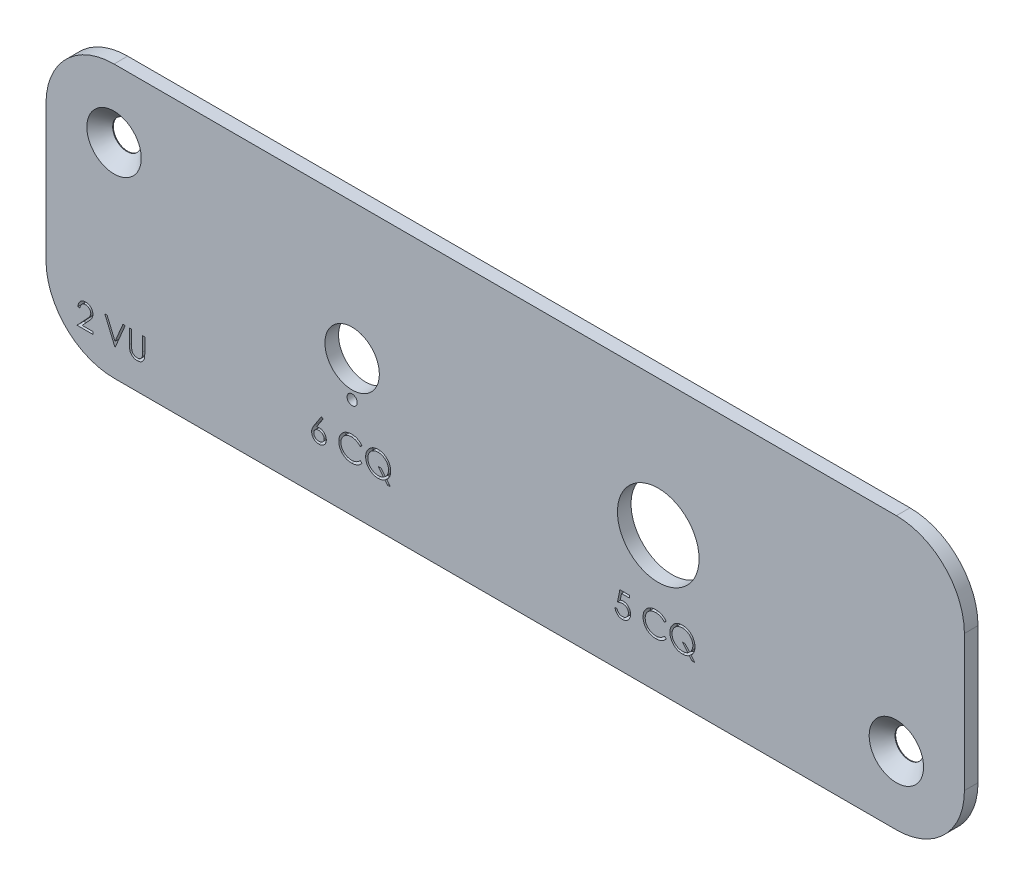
from build123d import *

# Parameters (mm, degrees)
ESQUISSE1_W             = 135
ESQUISSE1_H             = 40
BOSS_EXTRU_1_DEPTH      = 2
ESQUISSE2_R             = 2.1
ENL_V_MAT_EXTRU_1_DEPTH = 2
CHANFREIN1_SIZE         = 1.9
ESQUISSE3_R             = 4
ESQUISSE3_R_2           = 6
ESQUISSE3_R_3           = 0.75
ENL_V_MAT_EXTRU_3_DEPTH = 141.815482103
ENL_V_MAT_EXTRU_4_DEPTH = 1
ENL_V_MAT_EXTRU_5_DEPTH = 1
CONG_1_R                = 10


with BuildPart() as part:
    # Esquisse1 → Boss.-Extru.1 (new body)
    with BuildSketch(Plane.XY):
        with Locations((67.5, 20)):
            Rectangle(ESQUISSE1_W, ESQUISSE1_H)
    extrude(amount=BOSS_EXTRU_1_DEPTH)

    # Esquisse2 → Enl_v. mat.-Extru.1 (cut)
    with BuildSketch(Plane.XY.offset(2)):
        with Locations((10, 30)):
            Circle(ESQUISSE2_R)
        with Locations((125, 10)):
            Circle(ESQUISSE2_R)
    extrude(amount=-ENL_V_MAT_EXTRU_1_DEPTH, mode=Mode.SUBTRACT)

    # Chanfrein1
    chanfrein1_edges = [part.edges().sort_by_distance(p)[0] for p in [
        (7.9, 30, 2),
        (122.9, 10, 2),
    ]]
    chamfer(chanfrein1_edges, length=CHANFREIN1_SIZE)

    # Esquisse3 → Enl_v. mat.-Extru.3 (cut, through all)
    with BuildSketch(Plane.XY.offset(2)):
        with Locations((45, 20)):
            Circle(ESQUISSE3_R)
        with Locations((90, 20)):
            Circle(ESQUISSE3_R_2)
        with Locations((45, 14.75)):
            Circle(ESQUISSE3_R_3)
    extrude(amount=-ENL_V_MAT_EXTRU_3_DEPTH, mode=Mode.SUBTRACT)

    # Esquisse4 → Enl_v. mat.-Extru.4 (cut)
    with BuildSketch(Plane.XY.offset(2)):
        with BuildLine():
            Line((5.008669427, 6.446928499), (4.694566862, 6.446928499))
            add(Edge.make_bspline(
                [(4.694566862, 6.446928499), (4.696614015, 6.488599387), (4.70063457, 6.570439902), (4.719462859, 6.689763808), (4.746403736, 6.803818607), (4.78449519, 6.911688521), (4.831801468, 7.014327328), (4.888531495, 7.111327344), (4.955725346, 7.202318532), (5.03193208, 7.286457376), (5.114700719, 7.363644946), (5.204006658, 7.430300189), (5.297851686, 7.486617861), (5.395951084, 7.533699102), (5.499411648, 7.569038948), (5.607294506, 7.595260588), (5.720073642, 7.611036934), (5.796913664, 7.612732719), (5.835993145, 7.613595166)],
                knots=[0, 0, 0, 0, 1.10065271, 2.161652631, 3.183658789, 4.190468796, 5.17591951, 6.163126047, 7.15150782, 8.156236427, 9.156009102, 10.134482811, 11.092018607, 12.041330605, 13.001268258, 13.972401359, 14.968799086, 16, 16, 16, 16], degree=3))
            add(Edge.make_bspline(
                [(5.835993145, 7.613595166), (5.874371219, 7.61269671), (5.949782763, 7.610931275), (6.059844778, 7.595770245), (6.164622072, 7.572024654), (6.263909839, 7.538709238), (6.356915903, 7.49392481), (6.444338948, 7.440127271), (6.527219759, 7.37790744), (6.601826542, 7.304653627), (6.670334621, 7.226451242), (6.729436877, 7.142963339), (6.78005004, 7.056734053), (6.82223772, 6.967105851), (6.853293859, 6.873234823), (6.876872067, 6.77648762), (6.890199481, 6.675862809), (6.892244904, 6.607756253), (6.893284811, 6.573130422)],
                knots=[0, 0, 0, 0, 1.111607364, 2.184268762, 3.212621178, 4.221274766, 5.211760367, 6.196651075, 7.1921475, 8.207485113, 9.220403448, 10.201281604, 11.166441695, 12.114753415, 13.065576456, 14.026450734, 14.996634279, 16, 16, 16, 16], degree=3))
            add(Edge.make_bspline(
                [(6.893284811, 6.573130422), (6.891591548, 6.524382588), (6.888234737, 6.427742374), (6.85952036, 6.285727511), (6.814673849, 6.148134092), (6.760676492, 6.03739679), (6.706204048, 5.948163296), (6.657116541, 5.874694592), (6.59965173, 5.795589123), (6.532973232, 5.711111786), (6.45846036, 5.620600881), (6.375438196, 5.524111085), (6.283314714, 5.422639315), (6.218656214, 5.353333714), (6.185151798, 5.317421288)],
                knots=[0, 0, 0, 0, 1.184426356, 2.348067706, 3.509069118, 4.696110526, 5.333549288, 6.050745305, 6.844228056, 7.710549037, 8.667450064, 9.695053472, 10.805634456, 12, 12, 12, 12], degree=3))
            Line((6.185151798, 5.317421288), (5.309450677, 4.382825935))
            Line((5.309450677, 4.382825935), (6.938156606, 4.382825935))
            Line((6.938156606, 4.382825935), (6.938156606, 4.023851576))
            Line((6.938156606, 4.023851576), (4.559951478, 4.023851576))
            Line((4.559951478, 4.023851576), (5.917323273, 5.472369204))
            add(Edge.make_bspline(
                [(5.917323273, 5.472369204), (5.95037116, 5.506867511), (6.013849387, 5.573131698), (6.103631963, 5.669874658), (6.184270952, 5.759624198), (6.256288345, 5.842210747), (6.31812185, 5.918842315), (6.372994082, 5.987037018), (6.416959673, 6.049791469), (6.464675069, 6.122532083), (6.51088905, 6.2113444), (6.550601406, 6.319878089), (6.574816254, 6.431605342), (6.57772109, 6.507107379), (6.579182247, 6.545085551)],
                knots=[0, 0, 0, 0, 1.329631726, 2.553950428, 3.673215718, 4.687767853, 5.603093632, 6.413772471, 7.123043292, 7.734684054, 8.834405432, 9.900288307, 10.943827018, 12, 12, 12, 12], degree=3))
            add(Edge.make_bspline(
                [(6.579182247, 6.545085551), (6.578546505, 6.568966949), (6.577293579, 6.616032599), (6.566235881, 6.685038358), (6.549525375, 6.751603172), (6.525580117, 6.815931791), (6.493973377, 6.877377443), (6.455499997, 6.936014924), (6.411109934, 6.992703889), (6.359758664, 7.045857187), (6.303347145, 7.094538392), (6.243752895, 7.137662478), (6.180702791, 7.173701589), (6.114462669, 7.203245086), (6.045217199, 7.226420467), (5.972832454, 7.242479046), (5.897508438, 7.25256153), (5.846074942, 7.253925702), (5.819867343, 7.254620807)],
                knots=[0, 0, 0, 0, 0.991446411, 1.95395049, 2.89581595, 3.838931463, 4.798493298, 5.75982156, 6.748411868, 7.785213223, 8.824556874, 9.840280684, 10.836137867, 11.835679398, 12.848801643, 13.863922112, 14.911575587, 16, 16, 16, 16], degree=3))
            add(Edge.make_bspline(
                [(5.819867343, 7.254620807), (5.79249651, 7.253905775), (5.738744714, 7.252501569), (5.659825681, 7.242678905), (5.584539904, 7.225733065), (5.512698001, 7.202556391), (5.444178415, 7.173097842), (5.379314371, 7.136406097), (5.318251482, 7.092622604), (5.260874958, 7.042982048), (5.208010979, 6.987714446), (5.161564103, 6.926104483), (5.120980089, 6.859277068), (5.085570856, 6.787412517), (5.056815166, 6.709858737), (5.034842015, 6.626891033), (5.017455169, 6.538869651), (5.011646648, 6.478084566), (5.008669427, 6.446928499)],
                knots=[0, 0, 0, 0, 1.031018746, 2.02475058, 2.990194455, 3.934040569, 4.864654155, 5.795059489, 6.735614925, 7.690564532, 8.649604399, 9.611025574, 10.590972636, 11.591080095, 12.624614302, 13.701020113, 14.821632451, 16, 16, 16, 16], degree=3))
        make_face()
        Polygon((8.643284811, 7.523851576), (8.979823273, 7.523851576), (10.146489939, 4.765638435), (11.313156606, 7.523851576), (11.649695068, 7.523851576), (10.168925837, 4.023851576), (10.124054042, 4.023851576), align=None)
        with BuildLine():
            Line((12.277900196, 7.523851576), (12.59200276, 7.523851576))
            Line((12.59200276, 7.523851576), (12.59200276, 5.426796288))
            add(Edge.make_bspline(
                [(12.59200276, 5.426796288), (12.591956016, 5.397115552), (12.591867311, 5.340791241), (12.592459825, 5.260622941), (12.594119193, 5.189350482), (12.595165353, 5.126699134), (12.597492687, 5.072956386), (12.599390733, 5.027831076), (12.60183129, 4.991536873), (12.604764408, 4.970355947), (12.606025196, 4.961251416)],
                knots=[0, 0, 0, 0, 1.528628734, 2.90083645, 4.128790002, 5.200304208, 6.127813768, 6.898992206, 7.526736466, 8, 8, 8, 8], degree=3))
            add(Edge.make_bspline(
                [(12.606025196, 4.961251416), (12.611202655, 4.928404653), (12.621265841, 4.864561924), (12.646912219, 4.773653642), (12.68272972, 4.691722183), (12.725172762, 4.616210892), (12.781105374, 4.549221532), (12.848108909, 4.487509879), (12.929286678, 4.433538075), (13.019547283, 4.384187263), (13.116832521, 4.344522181), (13.216243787, 4.314528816), (13.316286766, 4.296249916), (13.383262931, 4.294133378), (13.416521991, 4.293082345)],
                knots=[0, 0, 0, 0, 1.035780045, 2.013197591, 2.933192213, 3.817615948, 4.702609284, 5.640816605, 6.646850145, 7.73207398, 8.84249596, 9.914020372, 10.964143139, 12, 12, 12, 12], degree=3))
            add(Edge.make_bspline(
                [(13.416521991, 4.293082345), (13.445075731, 4.294156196), (13.502018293, 4.296297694), (13.586624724, 4.309559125), (13.669024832, 4.333459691), (13.749625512, 4.364299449), (13.825176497, 4.40504704), (13.895719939, 4.45211788), (13.958683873, 4.507328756), (14.016141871, 4.5684291), (14.066176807, 4.6373689), (14.109547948, 4.712647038), (14.145073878, 4.795396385), (14.162617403, 4.853550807), (14.171630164, 4.883426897)],
                knots=[0, 0, 0, 0, 0.994687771, 1.983630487, 2.973142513, 3.978332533, 4.983357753, 5.956394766, 6.925816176, 7.893390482, 8.871859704, 9.88551698, 10.913711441, 12, 12, 12, 12], degree=3))
            add(Edge.make_bspline(
                [(14.171630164, 4.883426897), (14.174630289, 4.895775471), (14.181315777, 4.923293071), (14.187562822, 4.969814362), (14.194069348, 5.024703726), (14.198583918, 5.088355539), (14.202985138, 5.160556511), (14.205618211, 5.241682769), (14.206835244, 5.331439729), (14.207197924, 5.394076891), (14.207387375, 5.426796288)],
                knots=[0, 0, 0, 0, 0.558680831, 1.244966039, 2.062412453, 2.990489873, 4.051219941, 5.244515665, 6.560634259, 8, 8, 8, 8], degree=3))
            Line((14.207387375, 5.426796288), (14.207387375, 7.523851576))
            Line((14.207387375, 7.523851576), (14.521489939, 7.523851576))
            Line((14.521489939, 7.523851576), (14.521489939, 5.409969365))
            add(Edge.make_bspline(
                [(14.521489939, 5.409969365), (14.521235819, 5.371870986), (14.520739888, 5.297519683), (14.516439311, 5.188568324), (14.509582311, 5.085215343), (14.499894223, 4.987446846), (14.48705722, 4.895612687), (14.472782, 4.808907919), (14.454602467, 4.727954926), (14.433369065, 4.652122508), (14.409095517, 4.579936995), (14.377654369, 4.51142838), (14.342229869, 4.444513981), (14.300215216, 4.380205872), (14.253003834, 4.318219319), (14.199552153, 4.258930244), (14.141627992, 4.201391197), (14.078268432, 4.147078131), (14.010517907, 4.097269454), (13.938577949, 4.053471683), (13.86300118, 4.016448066), (13.783984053, 3.985972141), (13.701492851, 3.963057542), (13.615525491, 3.945982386), (13.525886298, 3.936280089), (13.464921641, 3.934838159), (13.434050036, 3.934107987)],
                knots=[0, 0, 0, 0, 1.316592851, 2.569410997, 3.76748051, 4.895814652, 5.963796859, 6.97159953, 7.931736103, 8.829262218, 9.692595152, 10.560224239, 11.431080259, 12.30701507, 13.211635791, 14.121146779, 15.063487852, 16.031507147, 17.00238618, 17.966455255, 18.938106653, 19.907068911, 20.888905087, 21.893141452, 22.933117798, 24, 24, 24, 24], degree=3))
            add(Edge.make_bspline(
                [(13.434050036, 3.934107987), (13.400380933, 3.934892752), (13.334322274, 3.936432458), (13.236984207, 3.945255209), (13.14367001, 3.961873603), (13.053394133, 3.983033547), (12.967385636, 4.012217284), (12.884492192, 4.046315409), (12.806133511, 4.088192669), (12.731038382, 4.134786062), (12.661213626, 4.1872107), (12.597116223, 4.244350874), (12.538640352, 4.305291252), (12.486771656, 4.370691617), (12.440650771, 4.440043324), (12.400920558, 4.513542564), (12.366807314, 4.59116088), (12.349200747, 4.645114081), (12.340300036, 4.672389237)],
                knots=[0, 0, 0, 0, 1.13879206, 2.234305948, 3.301075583, 4.341971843, 5.366689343, 6.369221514, 7.369726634, 8.367512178, 9.355451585, 10.318319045, 11.268648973, 12.207971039, 13.137398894, 14.081662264, 15.030215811, 16, 16, 16, 16], degree=3))
            add(Edge.make_bspline(
                [(12.340300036, 4.672389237), (12.335122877, 4.691021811), (12.323893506, 4.73143628), (12.311868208, 4.798322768), (12.301759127, 4.875337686), (12.292253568, 4.962486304), (12.286644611, 5.059836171), (12.281727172, 5.167345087), (12.277865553, 5.285143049), (12.277888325, 5.367197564), (12.277900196, 5.409969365)],
                knots=[0, 0, 0, 0, 0.625038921, 1.35572334, 2.194682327, 3.136881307, 4.189498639, 5.346923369, 6.617055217, 8, 8, 8, 8], degree=3))
            Line((12.277900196, 5.409969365), (12.277900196, 7.523851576))
        make_face()
    extrude(amount=-ENL_V_MAT_EXTRU_4_DEPTH, mode=Mode.SUBTRACT)

    # Esquisse5 → Enl_v. mat.-Extru.5 (cut)
    # profile 1 of 6: a face of its own
    with BuildSketch(Plane.XY.offset(2)):
        with BuildLine():
            Line((40.483264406, 10.341977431), (40.725151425, 10.151973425))
            Line((40.725151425, 10.151973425), (39.800371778, 8.737810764))
            add(Edge.make_bspline(
                [(39.800371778, 8.737810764), (39.861942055, 8.747624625), (39.982041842, 8.76676767), (40.10360774, 8.769925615), (40.162851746, 8.771464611)],
                knots=[0, 0, 0, 0, 1.025318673, 2, 2, 2, 2], degree=3))
            add(Edge.make_bspline(
                [(40.162851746, 8.771464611), (40.198424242, 8.770508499), (40.268447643, 8.768626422), (40.371254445, 8.754142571), (40.470043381, 8.731317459), (40.564404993, 8.698045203), (40.654677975, 8.655542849), (40.741380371, 8.604603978), (40.822882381, 8.542598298), (40.90023356, 8.473333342), (40.970460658, 8.396616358), (41.032636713, 8.315215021), (41.084863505, 8.22921414), (41.127237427, 8.138657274), (41.160142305, 8.043684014), (41.18412995, 7.944415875), (41.198309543, 7.840784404), (41.200235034, 7.770306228), (41.201213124, 7.734505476)],
                knots=[0, 0, 0, 0, 1.04369286, 2.054478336, 3.041073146, 4.015093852, 4.984733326, 5.965804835, 6.960378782, 7.985147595, 9.009457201, 10.008161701, 10.986880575, 11.956520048, 12.937015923, 13.931873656, 14.949455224, 16, 16, 16, 16], degree=3))
            add(Edge.make_bspline(
                [(41.201213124, 7.734505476), (41.199790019, 7.685525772), (41.196989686, 7.589145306), (41.16908589, 7.4487686), (41.125726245, 7.315036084), (41.063748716, 7.190082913), (40.986766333, 7.074080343), (40.892888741, 6.971294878), (40.785445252, 6.87962484), (40.663958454, 6.802968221), (40.53321549, 6.74036517), (40.395863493, 6.695399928), (40.253236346, 6.667716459), (40.156431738, 6.664245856), (40.107463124, 6.662490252)],
                knots=[0, 0, 0, 0, 1.031375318, 2.029502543, 3.004789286, 3.987476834, 4.960371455, 5.9300674, 6.912260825, 7.929083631, 8.949397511, 9.960523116, 10.96833055, 12, 12, 12, 12], degree=3))
            add(Edge.make_bspline(
                [(40.107463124, 6.662490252), (40.060366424, 6.664018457), (39.967076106, 6.667045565), (39.829843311, 6.694011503), (39.697980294, 6.737718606), (39.572410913, 6.797932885), (39.4560903, 6.873990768), (39.352024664, 6.965553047), (39.260732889, 7.070662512), (39.184758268, 7.189302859), (39.124499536, 7.316792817), (39.079309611, 7.449729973), (39.052913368, 7.587629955), (39.049224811, 7.681111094), (39.04736697, 7.72819538)],
                knots=[0, 0, 0, 0, 1.012016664, 2.004627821, 2.994792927, 3.992885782, 4.990978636, 5.973936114, 6.964471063, 7.975201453, 8.993600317, 9.990122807, 10.98767138, 12, 12, 12, 12], degree=3))
            add(Edge.make_bspline(
                [(39.04736697, 7.72819538), (39.048548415, 7.764239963), (39.0509607, 7.837836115), (39.067804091, 7.949300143), (39.094868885, 8.063351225), (39.125179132, 8.160105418), (39.157204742, 8.23936694), (39.183857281, 8.303270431), (39.217031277, 8.369031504), (39.252404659, 8.43890514), (39.293161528, 8.511090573), (39.337477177, 8.586794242), (39.386576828, 8.66481217), (39.420996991, 8.717756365), (39.438592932, 8.744821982)],
                knots=[0, 0, 0, 0, 1.173818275, 2.396712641, 3.66331629, 4.989737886, 5.693666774, 6.447286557, 7.243889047, 8.091586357, 8.998013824, 9.943181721, 10.948533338, 12, 12, 12, 12], degree=3))
            Line((39.438592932, 8.744821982), (40.483264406, 10.341977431))
        make_face()
        with BuildLine():
            add(Edge.make_bspline(
                [(40.096946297, 8.412490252), (40.070284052, 8.411712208), (40.018204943, 8.410192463), (39.941797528, 8.401367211), (39.869484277, 8.384748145), (39.800307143, 8.363581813), (39.73555944, 8.334478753), (39.6747706, 8.299126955), (39.617705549, 8.257505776), (39.564961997, 8.210204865), (39.517142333, 8.158416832), (39.475961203, 8.10294731), (39.440438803, 8.045133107), (39.411556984, 7.984491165), (39.389066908, 7.921044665), (39.372798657, 7.855085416), (39.363744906, 7.78617111), (39.362238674, 7.739438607), (39.361469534, 7.715575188)],
                knots=[0, 0, 0, 0, 1.129588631, 2.206414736, 3.251139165, 4.268635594, 5.265702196, 6.250456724, 7.242448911, 8.251968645, 9.246821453, 10.222880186, 11.173611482, 12.116736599, 13.062300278, 14.020270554, 14.989073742, 16, 16, 16, 16], degree=3))
            add(Edge.make_bspline(
                [(39.361469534, 7.715575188), (39.362095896, 7.691925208), (39.363324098, 7.645551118), (39.374476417, 7.577211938), (39.3915115, 7.51144703), (39.416851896, 7.448595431), (39.447078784, 7.387699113), (39.486984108, 7.330963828), (39.531200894, 7.274943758), (39.584054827, 7.223942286), (39.64077819, 7.176485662), (39.701379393, 7.135005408), (39.764539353, 7.099519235), (39.831110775, 7.071708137), (39.900149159, 7.048883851), (39.972229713, 7.032822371), (40.047402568, 7.023741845), (40.098324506, 7.022233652), (40.124290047, 7.021464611)],
                knots=[0, 0, 0, 0, 0.989467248, 1.94019797, 2.891935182, 3.827694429, 4.772920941, 5.730924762, 6.725747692, 7.756678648, 8.79901574, 9.819492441, 10.826891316, 11.826466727, 12.835195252, 13.867842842, 14.912794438, 16, 16, 16, 16], degree=3))
            add(Edge.make_bspline(
                [(40.124290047, 7.021464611), (40.150255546, 7.022233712), (40.2011774, 7.023742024), (40.276350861, 7.032821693), (40.348429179, 7.048886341), (40.417475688, 7.071699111), (40.484017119, 7.099552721), (40.54712184, 7.13478464), (40.607149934, 7.176740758), (40.663910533, 7.223861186), (40.716544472, 7.275234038), (40.761821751, 7.330463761), (40.800504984, 7.388157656), (40.831939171, 7.448355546), (40.857000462, 7.511485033), (40.87412193, 7.577201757), (40.885251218, 7.645553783), (40.886482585, 7.691926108), (40.88711056, 7.715575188)],
                knots=[0, 0, 0, 0, 1.087397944, 2.132534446, 3.165364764, 4.174271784, 5.174024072, 6.181601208, 7.194203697, 8.236725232, 9.267838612, 10.269026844, 11.221737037, 12.171628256, 13.107553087, 14.05945871, 15.010357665, 16, 16, 16, 16], degree=3))
            add(Edge.make_bspline(
                [(40.88711056, 7.715575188), (40.886560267, 7.739469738), (40.885480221, 7.786366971), (40.873264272, 7.855054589), (40.856321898, 7.921379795), (40.830738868, 7.984925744), (40.797502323, 8.045441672), (40.757018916, 8.103233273), (40.710186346, 8.15874362), (40.656088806, 8.210306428), (40.597198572, 8.257453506), (40.534582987, 8.299073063), (40.469075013, 8.334198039), (40.400741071, 8.363505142), (40.328798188, 8.384654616), (40.254407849, 8.401307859), (40.176618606, 8.410169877), (40.123841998, 8.411706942), (40.096946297, 8.412490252)],
                knots=[0, 0, 0, 0, 0.978206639, 1.919901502, 2.851605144, 3.780102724, 4.718870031, 5.675451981, 6.667674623, 7.690630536, 8.733308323, 9.756129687, 10.767539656, 11.776269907, 12.797430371, 13.836405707, 14.897401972, 16, 16, 16, 16], degree=3))
        make_face(mode=Mode.SUBTRACT)
    # profile 2 of 6: a face of its own
    with BuildSketch(Plane.XY.offset(2)):
        with BuildLine():
            Line((46.451213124, 9.610006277), (46.176373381, 9.399669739))
            add(Edge.make_bspline(
                [(46.176373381, 9.399669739), (46.156767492, 9.423035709), (46.117820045, 9.469452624), (46.055160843, 9.534632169), (45.9898592, 9.59569743), (45.921940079, 9.65293931), (45.850180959, 9.704356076), (45.776320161, 9.752627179), (45.699122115, 9.795894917), (45.592370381, 9.848357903), (45.452722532, 9.903104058), (45.276927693, 9.949007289), (45.093416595, 9.978228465), (44.968218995, 9.981393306), (44.904538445, 9.983003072)],
                knots=[0, 0, 0, 0, 0.757959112, 1.505699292, 2.245454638, 2.979532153, 3.711538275, 4.438200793, 5.171680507, 5.909471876, 7.393775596, 8.890124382, 10.418191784, 12, 12, 12, 12], degree=3))
            add(Edge.make_bspline(
                [(44.904538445, 9.983003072), (44.869455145, 9.98259911), (44.799614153, 9.981794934), (44.695965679, 9.971185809), (44.594252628, 9.956274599), (44.494541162, 9.934149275), (44.396958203, 9.906176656), (44.300865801, 9.872751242), (44.207655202, 9.831396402), (44.116036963, 9.785688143), (44.028257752, 9.734060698), (43.945202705, 9.677747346), (43.867174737, 9.617378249), (43.794112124, 9.552727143), (43.725940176, 9.484085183), (43.663152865, 9.410720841), (43.605967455, 9.332868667), (43.55325043, 9.25155526), (43.506037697, 9.167017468), (43.466507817, 9.078942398), (43.431502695, 8.988838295), (43.403803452, 8.895687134), (43.381878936, 8.800144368), (43.366751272, 8.70195358), (43.356262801, 8.601319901), (43.355462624, 8.533110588), (43.355059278, 8.498728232)],
                knots=[0, 0, 0, 0, 1.054917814, 2.100044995, 3.131103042, 4.146048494, 5.169673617, 6.183595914, 7.203665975, 8.234915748, 9.262203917, 10.264457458, 11.251630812, 12.227803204, 13.197192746, 14.159520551, 15.12972552, 16.100847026, 17.073214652, 18.039054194, 19.002613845, 19.979014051, 20.95965708, 21.949030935, 22.966165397, 24, 24, 24, 24], degree=3))
            add(Edge.make_bspline(
                [(43.355059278, 8.498728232), (43.356321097, 8.446996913), (43.358798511, 8.345429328), (43.380846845, 8.196658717), (43.414351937, 8.054138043), (43.464567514, 7.918758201), (43.526486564, 7.788849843), (43.604727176, 7.66661099), (43.695343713, 7.550194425), (43.799618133, 7.442351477), (43.914023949, 7.343837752), (44.03677186, 7.25708717), (44.167556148, 7.184772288), (44.304932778, 7.124596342), (44.449958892, 7.078339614), (44.602373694, 7.04577549), (44.76184569, 7.02453331), (44.87081509, 7.022499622), (44.92627322, 7.021464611)],
                knots=[0, 0, 0, 0, 1.029171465, 2.020641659, 2.987623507, 3.938342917, 4.889210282, 5.84687017, 6.821220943, 7.821438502, 8.827599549, 9.822697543, 10.807740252, 11.797342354, 12.80366471, 13.83203677, 14.896651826, 16, 16, 16, 16], degree=3))
            add(Edge.make_bspline(
                [(44.92627322, 7.021464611), (44.987375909, 7.02315339), (45.107640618, 7.026477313), (45.284008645, 7.054636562), (45.45284441, 7.10029448), (45.614156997, 7.164192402), (45.767491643, 7.24725769), (45.913088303, 7.347955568), (46.051069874, 7.4672439), (46.134041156, 7.558327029), (46.176373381, 7.604797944)],
                knots=[0, 0, 0, 0, 1.028121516, 2.023589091, 2.998037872, 3.967518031, 4.937445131, 5.927275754, 6.942489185, 8, 8, 8, 8], degree=3))
            Line((46.176373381, 7.604797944), (46.451213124, 7.396564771))
            add(Edge.make_bspline(
                [(46.451213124, 7.396564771), (46.429095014, 7.368026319), (46.384964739, 7.311086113), (46.313506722, 7.230814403), (46.238229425, 7.155310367), (46.158573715, 7.085182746), (46.075455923, 7.019028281), (45.987383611, 6.958726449), (45.895514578, 6.903435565), (45.800160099, 6.852808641), (45.701421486, 6.807891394), (45.599417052, 6.769437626), (45.494586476, 6.736312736), (45.386924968, 6.709060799), (45.276209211, 6.687789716), (45.162838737, 6.673570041), (45.046568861, 6.663828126), (44.96812744, 6.662940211), (44.928376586, 6.662490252)],
                knots=[0, 0, 0, 0, 0.986787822, 1.968848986, 2.935600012, 3.899624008, 4.868462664, 5.837806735, 6.815139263, 7.798259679, 8.787526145, 9.778297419, 10.776456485, 11.791383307, 12.812564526, 13.85620153, 14.913611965, 16, 16, 16, 16], degree=3))
            add(Edge.make_bspline(
                [(44.928376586, 6.662490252), (44.890732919, 6.662752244), (44.816297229, 6.663270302), (44.706398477, 6.671662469), (44.599408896, 6.683112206), (44.49563427, 6.700352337), (44.394508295, 6.720696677), (44.296947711, 6.747967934), (44.2019925, 6.778517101), (44.11002416, 6.814422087), (44.02096446, 6.85493827), (43.935100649, 6.900729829), (43.852472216, 6.951411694), (43.772266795, 7.005866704), (43.695669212, 7.065844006), (43.622015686, 7.13051064), (43.55089321, 7.199648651), (43.506890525, 7.249503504), (43.48476681, 7.274569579)],
                knots=[0, 0, 0, 0, 1.114604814, 2.203992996, 3.262667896, 4.300477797, 5.318619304, 6.316056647, 7.298880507, 8.271930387, 9.238335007, 10.195173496, 11.151986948, 12.108099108, 13.064862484, 14.031167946, 15.010108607, 16, 16, 16, 16], degree=3))
            add(Edge.make_bspline(
                [(43.48476681, 7.274569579), (43.449331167, 7.318110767), (43.37888769, 7.404667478), (43.288762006, 7.544953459), (43.211614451, 7.691421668), (43.14923853, 7.844841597), (43.100475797, 8.004868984), (43.066694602, 8.171584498), (43.044742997, 8.344832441), (43.042232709, 8.462669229), (43.040956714, 8.522566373)],
                knots=[0, 0, 0, 0, 0.994628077, 1.977248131, 2.950237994, 3.925870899, 4.908910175, 5.911660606, 6.938484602, 8, 8, 8, 8], degree=3))
            add(Edge.make_bspline(
                [(43.040956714, 8.522566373), (43.042511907, 8.585521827), (43.045571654, 8.709382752), (43.071567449, 8.891156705), (43.113386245, 9.065308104), (43.172783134, 9.231511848), (43.248088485, 9.390642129), (43.341115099, 9.541483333), (43.450782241, 9.685000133), (43.576229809, 9.819014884), (43.713797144, 9.941554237), (43.861115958, 10.049360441), (44.017897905, 10.139077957), (44.182415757, 10.214074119), (44.355901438, 10.271718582), (44.537984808, 10.312071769), (44.728323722, 10.337188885), (44.858186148, 10.340364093), (44.924169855, 10.341977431)],
                knots=[0, 0, 0, 0, 1.032925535, 2.032216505, 3.007276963, 3.968222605, 4.92396291, 5.891752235, 6.871517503, 7.883894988, 8.900124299, 9.891468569, 10.874487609, 11.85992873, 12.854644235, 13.869047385, 14.917252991, 16, 16, 16, 16], degree=3))
            add(Edge.make_bspline(
                [(44.924169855, 10.341977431), (44.964384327, 10.341495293), (45.043984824, 10.340540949), (45.161737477, 10.331234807), (45.276379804, 10.315721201), (45.387990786, 10.294605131), (45.497113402, 10.268397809), (45.602913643, 10.234257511), (45.70601233, 10.19522098), (45.805759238, 10.150262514), (45.901675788, 10.099795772), (45.993732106, 10.044380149), (46.081196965, 9.984084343), (46.164685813, 9.919421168), (46.242802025, 9.849022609), (46.317763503, 9.774825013), (46.387024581, 9.694691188), (46.429777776, 9.638286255), (46.451213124, 9.610006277)],
                knots=[0, 0, 0, 0, 1.096760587, 2.17092713, 3.219439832, 4.250915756, 5.268269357, 6.278326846, 7.281116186, 8.274029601, 9.260640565, 10.235837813, 11.203064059, 12.156899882, 13.114053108, 14.069676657, 15.032185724, 16, 16, 16, 16], degree=3))
        make_face()
    # profile 3 of 6: a face of its own
    with BuildSketch(Plane.XY.offset(2)):
        with BuildLine():
            Line((50.086529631, 7.142057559), (50.624290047, 6.483003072))
            Line((50.624290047, 6.483003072), (50.232362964, 6.483003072))
            Line((50.232362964, 6.483003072), (49.84394149, 6.958363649))
            add(Edge.make_bspline(
                [(49.84394149, 6.958363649), (49.804984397, 6.934689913), (49.727787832, 6.887778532), (49.607421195, 6.827312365), (49.484660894, 6.776996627), (49.359778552, 6.735426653), (49.232956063, 6.702152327), (49.103550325, 6.679058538), (48.972030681, 6.665648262), (48.883668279, 6.663546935), (48.839233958, 6.662490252)],
                knots=[0, 0, 0, 0, 1.030216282, 2.041455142, 3.041201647, 4.026904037, 5.014869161, 6.002481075, 6.995518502, 8, 8, 8, 8], degree=3))
            add(Edge.make_bspline(
                [(48.839233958, 6.662490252), (48.775573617, 6.664023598), (48.650309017, 6.667040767), (48.466338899, 6.693381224), (48.28975528, 6.734061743), (48.12091013, 6.792922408), (47.959619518, 6.86810489), (47.80595838, 6.960794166), (47.659848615, 7.069706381), (47.523447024, 7.194129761), (47.398721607, 7.329485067), (47.289282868, 7.474106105), (47.196230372, 7.625593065), (47.120991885, 7.784701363), (47.061280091, 7.95004585), (47.020588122, 8.123001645), (46.994248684, 8.302539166), (46.991214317, 8.424782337), (46.989674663, 8.486809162)],
                knots=[0, 0, 0, 0, 1.055750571, 2.07740284, 3.077223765, 4.05828044, 5.038417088, 6.02463293, 7.030503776, 8.057169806, 9.083586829, 10.080154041, 11.061747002, 12.027853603, 12.995569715, 13.972756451, 14.971366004, 16, 16, 16, 16], degree=3))
            add(Edge.make_bspline(
                [(46.989674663, 8.486809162), (46.990222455, 8.528440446), (46.991314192, 8.611410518), (47.003943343, 8.73429769), (47.022707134, 8.85516182), (47.049247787, 8.973500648), (47.083991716, 9.089799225), (47.125646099, 9.20382823), (47.176115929, 9.315293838), (47.233170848, 9.423967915), (47.296803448, 9.528908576), (47.366119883, 9.628622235), (47.44129068, 9.722126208), (47.52226262, 9.809377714), (47.608712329, 9.890569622), (47.699896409, 9.967038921), (47.797759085, 10.03594087), (47.89971746, 10.10001692), (48.006343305, 10.156362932), (48.115551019, 10.206734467), (48.228157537, 10.24760462), (48.342701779, 10.282430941), (48.459878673, 10.309018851), (48.579596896, 10.32764509), (48.701772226, 10.340396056), (48.784279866, 10.341447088), (48.825912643, 10.341977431)],
                knots=[0, 0, 0, 0, 1.030721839, 2.054201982, 3.056261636, 4.058906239, 5.055198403, 6.060579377, 7.06322398, 8.083343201, 9.098870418, 10.10084648, 11.0888991, 12.067804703, 13.046436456, 14.024708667, 15.012489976, 16.008294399, 17.005242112, 17.997338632, 18.984424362, 19.969624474, 20.960977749, 21.957320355, 22.969278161, 24, 24, 24, 24], degree=3))
            add(Edge.make_bspline(
                [(48.825912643, 10.341977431), (48.889573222, 10.340451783), (49.014606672, 10.337455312), (49.198121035, 10.311110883), (49.374184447, 10.270267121), (49.542671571, 10.211706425), (49.703432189, 10.136334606), (49.85639876, 10.043664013), (50.001808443, 9.934744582), (50.137497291, 9.810312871), (50.261928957, 9.67462403), (50.370848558, 9.529214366), (50.463518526, 9.376247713), (50.538892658, 9.215487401), (50.597444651, 9.046999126), (50.638374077, 8.870714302), (50.664592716, 8.686947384), (50.667622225, 8.561685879), (50.669161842, 8.498027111)],
                knots=[0, 0, 0, 0, 1.050672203, 2.063587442, 3.054842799, 4.031180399, 5.003107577, 5.981273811, 6.979214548, 7.998088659, 9.016962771, 10.014903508, 10.993069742, 11.96499692, 12.941334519, 13.932589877, 14.949327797, 16, 16, 16, 16], degree=3))
            add(Edge.make_bspline(
                [(50.669161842, 8.498027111), (50.667479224, 8.431789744), (50.664170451, 8.301537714), (50.636012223, 8.110536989), (50.590738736, 7.928086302), (50.526535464, 7.754305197), (50.443535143, 7.58922526), (50.343341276, 7.431195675), (50.224747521, 7.280227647), (50.133087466, 7.188599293), (50.086529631, 7.142057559)],
                knots=[0, 0, 0, 0, 1.045660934, 2.056233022, 3.041853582, 4.009978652, 4.97562384, 5.954545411, 6.961031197, 8, 8, 8, 8], degree=3))
        make_face()
        with BuildLine():
            add(Edge.make_bspline(
                [(49.87549197, 7.400771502), (49.913680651, 7.439554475), (49.98879948, 7.515842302), (50.086264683, 7.640950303), (50.170094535, 7.770997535), (50.237209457, 7.907713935), (50.290608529, 8.049386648), (50.327501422, 8.197138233), (50.350601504, 8.350296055), (50.353562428, 8.45447541), (50.355059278, 8.507141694)],
                knots=[0, 0, 0, 0, 1.052210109, 2.069743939, 3.061837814, 4.040478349, 5.010453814, 5.985306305, 6.981502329, 8, 8, 8, 8], degree=3))
            add(Edge.make_bspline(
                [(50.355059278, 8.507141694), (50.354668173, 8.541058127), (50.353895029, 8.608104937), (50.343264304, 8.707322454), (50.328224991, 8.804348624), (50.306452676, 8.899010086), (50.278415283, 8.991115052), (50.243786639, 9.08053849), (50.20324143, 9.167568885), (50.155974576, 9.251665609), (50.103866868, 9.332706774), (50.045864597, 9.409701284), (49.982784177, 9.482252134), (49.915314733, 9.551554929), (49.842155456, 9.616181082), (49.763568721, 9.676102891), (49.680522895, 9.732770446), (49.592607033, 9.78392023), (49.502009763, 9.830944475), (49.409261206, 9.87166456), (49.315140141, 9.906153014), (49.219792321, 9.934118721), (49.123341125, 9.956131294), (49.025617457, 9.971153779), (48.926874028, 9.981773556), (48.860529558, 9.982592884), (48.827314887, 9.983003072)],
                knots=[0, 0, 0, 0, 1.032958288, 2.041976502, 3.037103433, 4.023477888, 4.998866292, 5.968231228, 6.943073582, 7.921783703, 8.90545537, 9.876780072, 10.85618943, 11.833110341, 12.821898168, 13.827467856, 14.842673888, 15.88323808, 16.924703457, 17.951432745, 18.967462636, 19.976958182, 20.977218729, 21.979378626, 22.98839684, 24, 24, 24, 24], degree=3))
            add(Edge.make_bspline(
                [(48.827314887, 9.983003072), (48.793867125, 9.982590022), (48.727057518, 9.981764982), (48.627837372, 9.971212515), (48.529889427, 9.956114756), (48.433644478, 9.934211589), (48.338761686, 9.906191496), (48.245535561, 9.871494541), (48.15315536, 9.831780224), (48.063538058, 9.784786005), (47.976840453, 9.733196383), (47.894385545, 9.677092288), (47.81730332, 9.615913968), (47.744862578, 9.550646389), (47.677244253, 9.480785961), (47.614129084, 9.406797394), (47.556625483, 9.327822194), (47.503941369, 9.245273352), (47.457376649, 9.15906118), (47.41538118, 9.07074115), (47.381271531, 8.979339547), (47.353268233, 8.885587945), (47.330385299, 8.789719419), (47.31563636, 8.691177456), (47.304925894, 8.590577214), (47.304163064, 8.52259606), (47.303777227, 8.488211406)],
                knots=[0, 0, 0, 0, 1.013205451, 2.023808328, 3.020541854, 4.015386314, 5.012622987, 6.016502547, 7.02834558, 8.057881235, 9.080621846, 10.084476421, 11.077781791, 12.060654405, 13.037357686, 14.022218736, 15.005346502, 15.995617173, 16.98763393, 17.973029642, 18.956998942, 19.940662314, 20.93709383, 21.940823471, 22.958474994, 24, 24, 24, 24], degree=3))
            add(Edge.make_bspline(
                [(47.303777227, 8.488211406), (47.305090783, 8.437658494), (47.307674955, 8.338205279), (47.329097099, 8.192190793), (47.365014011, 8.052404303), (47.415263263, 7.918645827), (47.478344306, 7.790144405), (47.556790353, 7.668158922), (47.650266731, 7.553154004), (47.755237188, 7.444339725), (47.870706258, 7.345758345), (47.993114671, 7.258995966), (48.121417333, 7.185385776), (48.256017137, 7.125973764), (48.395910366, 7.078263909), (48.542201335, 7.045963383), (48.693933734, 7.024553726), (48.797325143, 7.022503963), (48.849750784, 7.021464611)],
                knots=[0, 0, 0, 0, 1.022526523, 2.011626, 2.97850031, 3.937665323, 4.897797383, 5.869804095, 6.865337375, 7.89202157, 8.925035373, 9.93268082, 10.923937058, 11.912550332, 12.905497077, 13.90928476, 14.939882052, 16, 16, 16, 16], degree=3))
            add(Edge.make_bspline(
                [(48.849750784, 7.021464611), (48.885769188, 7.021856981), (48.957011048, 7.022633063), (49.062065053, 7.033213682), (49.164548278, 7.04810612), (49.263511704, 7.07075606), (49.359813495, 7.098914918), (49.452880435, 7.133167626), (49.543206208, 7.1737745), (49.600639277, 7.205899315), (49.62939822, 7.221985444)],
                knots=[0, 0, 0, 0, 1.060694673, 2.097979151, 3.107774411, 4.11000626, 5.086069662, 6.061987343, 7.029562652, 8, 8, 8, 8], degree=3))
            Line((49.62939822, 7.221985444), (48.841337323, 8.188131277))
            Line((48.841337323, 8.188131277), (49.233264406, 8.188131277))
            Line((49.233264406, 8.188131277), (49.87549197, 7.400771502))
        make_face(mode=Mode.SUBTRACT)
    # profile 4 of 6: a face of its own
    with BuildSketch(Plane.XY.offset(2)):
        with BuildLine():
            Line((85.790456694, 10.252233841), (85.790456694, 9.893259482))
            Line((85.790456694, 9.893259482), (84.599951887, 9.893259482))
            Line((84.599951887, 9.893259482), (84.411350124, 8.972686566))
            add(Edge.make_bspline(
                [(84.411350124, 8.972686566), (84.448405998, 8.982916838), (84.520195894, 9.002736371), (84.626155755, 9.024742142), (84.726747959, 9.038007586), (84.792023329, 9.039818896), (84.823609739, 9.04069538)],
                knots=[0, 0, 0, 0, 1.100273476, 2.13160584, 3.095893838, 4, 4, 4, 4], degree=3))
            add(Edge.make_bspline(
                [(84.823609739, 9.04069538), (84.862693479, 9.039849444), (84.939541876, 9.038186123), (85.051980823, 9.022214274), (85.159313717, 8.997074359), (85.261316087, 8.961953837), (85.358176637, 8.917044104), (85.449004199, 8.860944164), (85.535162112, 8.795410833), (85.615104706, 8.720065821), (85.687629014, 8.637144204), (85.751395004, 8.547986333), (85.805557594, 8.453458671), (85.849118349, 8.352658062), (85.883902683, 8.246698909), (85.907054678, 8.134466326), (85.922471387, 8.017018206), (85.924193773, 7.936713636), (85.925072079, 7.895763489)],
                knots=[0, 0, 0, 0, 1.052922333, 2.070308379, 3.05430497, 4.020497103, 4.973039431, 5.925935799, 6.892292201, 7.88610001, 8.88166317, 9.857072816, 10.836096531, 11.812156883, 12.81219415, 13.836441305, 14.89672472, 16, 16, 16, 16], degree=3))
            add(Edge.make_bspline(
                [(85.925072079, 7.895763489), (85.924407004, 7.867241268), (85.923085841, 7.810582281), (85.916367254, 7.72643808), (85.903431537, 7.644075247), (85.886063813, 7.563482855), (85.863521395, 7.484813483), (85.836232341, 7.407841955), (85.802836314, 7.333047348), (85.766204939, 7.259721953), (85.724958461, 7.189523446), (85.679179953, 7.12387446), (85.630814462, 7.061790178), (85.578773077, 7.003936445), (85.522572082, 6.950693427), (85.462892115, 6.901745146), (85.400209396, 6.856263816), (85.333554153, 6.81609562), (85.26441167, 6.779132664), (85.191783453, 6.748809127), (85.117322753, 6.721698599), (85.039957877, 6.700089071), (84.959864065, 6.683156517), (84.876909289, 6.671655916), (84.791528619, 6.663279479), (84.733653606, 6.662755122), (84.704419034, 6.662490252)],
                knots=[0, 0, 0, 0, 1.056347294, 2.098418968, 3.122841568, 4.141288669, 5.149314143, 6.15115421, 7.162517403, 8.180376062, 9.185164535, 10.17417709, 11.141909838, 12.097768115, 13.052685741, 14.0056014, 14.954263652, 15.917497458, 16.885230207, 17.854509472, 18.828990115, 19.81800267, 20.826176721, 21.857883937, 22.917946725, 24, 24, 24, 24], degree=3))
            add(Edge.make_bspline(
                [(84.704419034, 6.662490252), (84.669544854, 6.66318109), (84.600934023, 6.664540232), (84.500413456, 6.678758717), (84.40369885, 6.699122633), (84.311568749, 6.729758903), (84.223197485, 6.768146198), (84.139774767, 6.816662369), (84.059168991, 6.871641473), (83.984656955, 6.936521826), (83.915500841, 7.007437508), (83.853594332, 7.084395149), (83.798460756, 7.166124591), (83.750983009, 7.253022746), (83.710484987, 7.344861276), (83.678669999, 7.441984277), (83.652991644, 7.543884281), (83.642128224, 7.614037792), (83.636610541, 7.649669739)],
                knots=[0, 0, 0, 0, 1.0467383, 2.05933395, 3.04377827, 4.011590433, 4.970194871, 5.932262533, 6.905835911, 7.896367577, 8.894135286, 9.877477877, 10.858688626, 11.851381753, 12.8477658, 13.868841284, 14.917554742, 16, 16, 16, 16], degree=3))
            Line((83.636610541, 7.649669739), (83.950713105, 7.649669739))
            add(Edge.make_bspline(
                [(83.950713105, 7.649669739), (83.958441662, 7.616293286), (83.973296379, 7.552141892), (84.005902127, 7.46201055), (84.045768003, 7.381691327), (84.093172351, 7.310121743), (84.149722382, 7.247712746), (84.214251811, 7.192095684), (84.286599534, 7.141920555), (84.366992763, 7.100097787), (84.451805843, 7.064429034), (84.540573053, 7.040677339), (84.630877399, 7.023976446), (84.691955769, 7.022304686), (84.722648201, 7.021464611)],
                knots=[0, 0, 0, 0, 1.136247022, 2.183929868, 3.172523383, 4.106158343, 5.02341133, 5.958108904, 6.928429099, 7.938127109, 8.96079061, 9.975095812, 10.982467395, 12, 12, 12, 12], degree=3))
            add(Edge.make_bspline(
                [(84.722648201, 7.021464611), (84.752606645, 7.022285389), (84.811595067, 7.023901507), (84.898406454, 7.036340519), (84.982219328, 7.05549809), (85.062206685, 7.084167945), (85.139768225, 7.119012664), (85.212941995, 7.16372774), (85.283844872, 7.215187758), (85.350273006, 7.274144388), (85.411112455, 7.339114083), (85.464868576, 7.408591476), (85.50964549, 7.482708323), (85.547379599, 7.560181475), (85.576032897, 7.641860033), (85.596473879, 7.727361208), (85.608476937, 7.816896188), (85.610128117, 7.877965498), (85.610969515, 7.909084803)],
                knots=[0, 0, 0, 0, 1.027316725, 2.022795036, 3.002884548, 3.971462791, 4.93288096, 5.914575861, 6.907176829, 7.935150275, 8.956128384, 9.956726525, 10.942570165, 11.921478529, 12.907843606, 13.90538589, 14.932640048, 16, 16, 16, 16], degree=3))
            add(Edge.make_bspline(
                [(85.610969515, 7.909084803), (85.610311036, 7.937160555), (85.609022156, 7.992114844), (85.598491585, 8.07251405), (85.580174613, 8.148587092), (85.554750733, 8.220701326), (85.522471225, 8.288924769), (85.483024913, 8.353327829), (85.435671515, 8.413061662), (85.381579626, 8.468154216), (85.322321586, 8.518999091), (85.256877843, 8.562343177), (85.186617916, 8.598807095), (85.112388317, 8.630275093), (85.032423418, 8.652875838), (84.948306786, 8.669843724), (84.859130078, 8.679659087), (84.79815939, 8.681020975), (84.766818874, 8.681721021)],
                knots=[0, 0, 0, 0, 1.045622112, 2.046656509, 3.013763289, 3.955457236, 4.890082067, 5.820317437, 6.762574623, 7.722996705, 8.69280354, 9.665887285, 10.63943826, 11.638615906, 12.663482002, 13.728887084, 14.832589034, 16, 16, 16, 16], degree=3))
            add(Edge.make_bspline(
                [(84.766818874, 8.681721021), (84.739689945, 8.68114043), (84.68367559, 8.679941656), (84.597752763, 8.671115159), (84.50746104, 8.656875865), (84.413146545, 8.637289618), (84.314526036, 8.611658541), (84.211807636, 8.58094404), (84.104775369, 8.544222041), (84.032657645, 8.516489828), (83.9955849, 8.502233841)],
                knots=[0, 0, 0, 0, 0.817624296, 1.688186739, 2.600797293, 3.572016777, 4.590301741, 5.671205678, 6.80286297, 8, 8, 8, 8], degree=3))
            Line((83.9955849, 8.502233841), (84.354559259, 10.252233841))
            Line((84.354559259, 10.252233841), (85.790456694, 10.252233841))
        make_face()
    # profile 5 of 6: a face of its own
    with BuildSketch(Plane.XY.offset(2)):
        with BuildLine():
            Line((91.175072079, 9.610006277), (90.900232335, 9.399669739))
            add(Edge.make_bspline(
                [(90.900232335, 9.399669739), (90.880626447, 9.423035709), (90.841679, 9.469452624), (90.779019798, 9.534632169), (90.713718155, 9.59569743), (90.645799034, 9.65293931), (90.574039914, 9.704356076), (90.500179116, 9.752627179), (90.42298107, 9.795894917), (90.316229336, 9.848357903), (90.176581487, 9.903104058), (90.000786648, 9.949007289), (89.81727555, 9.978228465), (89.69207795, 9.981393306), (89.6283974, 9.983003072)],
                knots=[0, 0, 0, 0, 0.757959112, 1.505699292, 2.245454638, 2.979532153, 3.711538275, 4.438200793, 5.171680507, 5.909471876, 7.393775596, 8.890124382, 10.418191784, 12, 12, 12, 12], degree=3))
            add(Edge.make_bspline(
                [(89.6283974, 9.983003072), (89.5933141, 9.98259911), (89.523473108, 9.981794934), (89.419824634, 9.971185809), (89.318111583, 9.956274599), (89.218400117, 9.934149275), (89.120817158, 9.906176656), (89.024724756, 9.872751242), (88.931514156, 9.831396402), (88.839895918, 9.785688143), (88.752116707, 9.734060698), (88.669061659, 9.677747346), (88.591033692, 9.617378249), (88.517971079, 9.552727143), (88.449799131, 9.484085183), (88.38701182, 9.410720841), (88.32982641, 9.332868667), (88.277109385, 9.25155526), (88.229896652, 9.167017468), (88.190366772, 9.078942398), (88.15536165, 8.988838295), (88.127662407, 8.895687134), (88.10573789, 8.800144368), (88.090610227, 8.70195358), (88.080121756, 8.601319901), (88.079321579, 8.533110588), (88.078918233, 8.498728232)],
                knots=[0, 0, 0, 0, 1.054917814, 2.100044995, 3.131103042, 4.146048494, 5.169673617, 6.183595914, 7.203665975, 8.234915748, 9.262203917, 10.264457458, 11.251630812, 12.227803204, 13.197192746, 14.159520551, 15.12972552, 16.100847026, 17.073214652, 18.039054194, 19.002613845, 19.979014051, 20.95965708, 21.949030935, 22.966165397, 24, 24, 24, 24], degree=3))
            add(Edge.make_bspline(
                [(88.078918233, 8.498728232), (88.080180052, 8.446996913), (88.082657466, 8.345429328), (88.1047058, 8.196658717), (88.138210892, 8.054138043), (88.188426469, 7.918758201), (88.250345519, 7.788849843), (88.328586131, 7.66661099), (88.419202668, 7.550194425), (88.523477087, 7.442351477), (88.637882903, 7.343837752), (88.760630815, 7.25708717), (88.891415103, 7.184772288), (89.028791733, 7.124596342), (89.173817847, 7.078339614), (89.326232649, 7.04577549), (89.485704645, 7.02453331), (89.594674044, 7.022499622), (89.650132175, 7.021464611)],
                knots=[0, 0, 0, 0, 1.029171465, 2.020641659, 2.987623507, 3.938342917, 4.889210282, 5.84687017, 6.821220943, 7.821438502, 8.827599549, 9.822697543, 10.807740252, 11.797342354, 12.80366471, 13.83203677, 14.896651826, 16, 16, 16, 16], degree=3))
            add(Edge.make_bspline(
                [(89.650132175, 7.021464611), (89.711234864, 7.02315339), (89.831499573, 7.026477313), (90.007867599, 7.054636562), (90.176703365, 7.10029448), (90.338015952, 7.164192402), (90.491350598, 7.24725769), (90.636947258, 7.347955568), (90.774928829, 7.4672439), (90.857900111, 7.558327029), (90.900232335, 7.604797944)],
                knots=[0, 0, 0, 0, 1.028121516, 2.023589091, 2.998037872, 3.967518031, 4.937445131, 5.927275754, 6.942489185, 8, 8, 8, 8], degree=3))
            Line((90.900232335, 7.604797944), (91.175072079, 7.396564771))
            add(Edge.make_bspline(
                [(91.175072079, 7.396564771), (91.152953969, 7.368026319), (91.108823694, 7.311086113), (91.037365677, 7.230814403), (90.96208838, 7.155310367), (90.88243267, 7.085182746), (90.799314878, 7.019028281), (90.711242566, 6.958726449), (90.619373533, 6.903435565), (90.524019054, 6.852808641), (90.425280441, 6.807891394), (90.323276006, 6.769437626), (90.218445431, 6.736312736), (90.110783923, 6.709060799), (90.000068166, 6.687789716), (89.886697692, 6.673570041), (89.770427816, 6.663828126), (89.691986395, 6.662940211), (89.652235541, 6.662490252)],
                knots=[0, 0, 0, 0, 0.986787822, 1.968848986, 2.935600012, 3.899624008, 4.868462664, 5.837806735, 6.815139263, 7.798259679, 8.787526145, 9.778297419, 10.776456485, 11.791383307, 12.812564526, 13.85620153, 14.913611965, 16, 16, 16, 16], degree=3))
            add(Edge.make_bspline(
                [(89.652235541, 6.662490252), (89.614591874, 6.662752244), (89.540156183, 6.663270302), (89.430257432, 6.671662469), (89.323267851, 6.683112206), (89.219493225, 6.700352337), (89.11836725, 6.720696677), (89.020806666, 6.747967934), (88.925851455, 6.778517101), (88.833883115, 6.814422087), (88.744823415, 6.85493827), (88.658959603, 6.900729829), (88.576331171, 6.951411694), (88.49612575, 7.005866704), (88.419528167, 7.065844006), (88.345874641, 7.13051064), (88.274752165, 7.199648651), (88.23074948, 7.249503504), (88.208625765, 7.274569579)],
                knots=[0, 0, 0, 0, 1.114604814, 2.203992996, 3.262667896, 4.300477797, 5.318619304, 6.316056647, 7.298880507, 8.271930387, 9.238335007, 10.195173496, 11.151986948, 12.108099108, 13.064862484, 14.031167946, 15.010108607, 16, 16, 16, 16], degree=3))
            add(Edge.make_bspline(
                [(88.208625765, 7.274569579), (88.173190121, 7.318110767), (88.102746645, 7.404667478), (88.012620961, 7.544953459), (87.935473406, 7.691421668), (87.873097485, 7.844841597), (87.824334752, 8.004868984), (87.790553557, 8.171584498), (87.768601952, 8.344832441), (87.766091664, 8.462669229), (87.764815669, 8.522566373)],
                knots=[0, 0, 0, 0, 0.994628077, 1.977248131, 2.950237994, 3.925870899, 4.908910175, 5.911660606, 6.938484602, 8, 8, 8, 8], degree=3))
            add(Edge.make_bspline(
                [(87.764815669, 8.522566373), (87.766370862, 8.585521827), (87.769430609, 8.709382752), (87.795426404, 8.891156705), (87.8372452, 9.065308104), (87.896642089, 9.231511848), (87.97194744, 9.390642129), (88.064974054, 9.541483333), (88.174641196, 9.685000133), (88.300088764, 9.819014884), (88.437656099, 9.941554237), (88.584974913, 10.049360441), (88.74175686, 10.139077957), (88.906274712, 10.214074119), (89.079760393, 10.271718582), (89.261843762, 10.312071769), (89.452182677, 10.337188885), (89.582045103, 10.340364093), (89.64802881, 10.341977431)],
                knots=[0, 0, 0, 0, 1.032925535, 2.032216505, 3.007276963, 3.968222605, 4.92396291, 5.891752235, 6.871517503, 7.883894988, 8.900124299, 9.891468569, 10.874487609, 11.85992873, 12.854644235, 13.869047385, 14.917252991, 16, 16, 16, 16], degree=3))
            add(Edge.make_bspline(
                [(89.64802881, 10.341977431), (89.688243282, 10.341495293), (89.767843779, 10.340540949), (89.885596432, 10.331234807), (90.000238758, 10.315721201), (90.11184974, 10.294605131), (90.220972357, 10.268397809), (90.326772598, 10.234257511), (90.429871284, 10.19522098), (90.529618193, 10.150262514), (90.625534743, 10.099795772), (90.717591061, 10.044380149), (90.80505592, 9.984084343), (90.888544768, 9.919421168), (90.966660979, 9.849022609), (91.041622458, 9.774825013), (91.110883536, 9.694691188), (91.153636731, 9.638286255), (91.175072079, 9.610006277)],
                knots=[0, 0, 0, 0, 1.096760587, 2.17092713, 3.219439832, 4.250915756, 5.268269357, 6.278326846, 7.281116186, 8.274029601, 9.260640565, 10.235837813, 11.203064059, 12.156899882, 13.114053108, 14.069676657, 15.032185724, 16, 16, 16, 16], degree=3))
        make_face()
    # profile 6 of 6: a face of its own
    with BuildSketch(Plane.XY.offset(2)):
        with BuildLine():
            Line((94.810388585, 7.142057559), (95.348149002, 6.483003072))
            Line((95.348149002, 6.483003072), (94.956221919, 6.483003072))
            Line((94.956221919, 6.483003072), (94.567800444, 6.958363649))
            add(Edge.make_bspline(
                [(94.567800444, 6.958363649), (94.528843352, 6.934689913), (94.451646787, 6.887778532), (94.33128015, 6.827312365), (94.208519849, 6.776996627), (94.083637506, 6.735426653), (93.956815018, 6.702152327), (93.82740928, 6.679058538), (93.695889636, 6.665648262), (93.607527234, 6.663546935), (93.563092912, 6.662490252)],
                knots=[0, 0, 0, 0, 1.030216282, 2.041455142, 3.041201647, 4.026904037, 5.014869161, 6.002481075, 6.995518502, 8, 8, 8, 8], degree=3))
            add(Edge.make_bspline(
                [(93.563092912, 6.662490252), (93.499432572, 6.664023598), (93.374167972, 6.667040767), (93.190197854, 6.693381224), (93.013614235, 6.734061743), (92.844769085, 6.792922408), (92.683478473, 6.86810489), (92.529817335, 6.960794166), (92.383707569, 7.069706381), (92.247305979, 7.194129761), (92.122580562, 7.329485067), (92.013141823, 7.474106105), (91.920089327, 7.625593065), (91.84485084, 7.784701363), (91.785139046, 7.95004585), (91.744447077, 8.123001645), (91.718107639, 8.302539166), (91.715073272, 8.424782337), (91.713533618, 8.486809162)],
                knots=[0, 0, 0, 0, 1.055750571, 2.07740284, 3.077223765, 4.05828044, 5.038417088, 6.02463293, 7.030503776, 8.057169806, 9.083586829, 10.080154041, 11.061747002, 12.027853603, 12.995569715, 13.972756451, 14.971366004, 16, 16, 16, 16], degree=3))
            add(Edge.make_bspline(
                [(91.713533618, 8.486809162), (91.71408141, 8.528440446), (91.715173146, 8.611410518), (91.727802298, 8.73429769), (91.746566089, 8.85516182), (91.773106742, 8.973500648), (91.807850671, 9.089799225), (91.849505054, 9.20382823), (91.899974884, 9.315293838), (91.957029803, 9.423967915), (92.020662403, 9.528908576), (92.089978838, 9.628622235), (92.165149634, 9.722126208), (92.246121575, 9.809377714), (92.332571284, 9.890569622), (92.423755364, 9.967038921), (92.52161804, 10.03594087), (92.623576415, 10.10001692), (92.73020226, 10.156362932), (92.839409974, 10.206734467), (92.952016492, 10.24760462), (93.066560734, 10.282430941), (93.183737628, 10.309018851), (93.303455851, 10.32764509), (93.425631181, 10.340396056), (93.508138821, 10.341447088), (93.549771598, 10.341977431)],
                knots=[0, 0, 0, 0, 1.030721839, 2.054201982, 3.056261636, 4.058906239, 5.055198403, 6.060579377, 7.06322398, 8.083343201, 9.098870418, 10.10084648, 11.0888991, 12.067804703, 13.046436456, 14.024708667, 15.012489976, 16.008294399, 17.005242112, 17.997338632, 18.984424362, 19.969624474, 20.960977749, 21.957320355, 22.969278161, 24, 24, 24, 24], degree=3))
            add(Edge.make_bspline(
                [(93.549771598, 10.341977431), (93.613432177, 10.340451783), (93.738465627, 10.337455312), (93.92197999, 10.311110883), (94.098043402, 10.270267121), (94.266530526, 10.211706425), (94.427291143, 10.136334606), (94.580257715, 10.043664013), (94.725667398, 9.934744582), (94.861356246, 9.810312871), (94.985787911, 9.67462403), (95.094707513, 9.529214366), (95.187377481, 9.376247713), (95.262751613, 9.215487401), (95.321303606, 9.046999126), (95.362233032, 8.870714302), (95.388451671, 8.686947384), (95.39148118, 8.561685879), (95.393020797, 8.498027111)],
                knots=[0, 0, 0, 0, 1.050672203, 2.063587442, 3.054842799, 4.031180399, 5.003107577, 5.981273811, 6.979214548, 7.998088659, 9.016962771, 10.014903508, 10.993069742, 11.96499692, 12.941334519, 13.932589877, 14.949327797, 16, 16, 16, 16], degree=3))
            add(Edge.make_bspline(
                [(95.393020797, 8.498027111), (95.391338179, 8.431789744), (95.388029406, 8.301537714), (95.359871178, 8.110536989), (95.314597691, 7.928086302), (95.250394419, 7.754305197), (95.167394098, 7.58922526), (95.067200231, 7.431195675), (94.948606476, 7.280227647), (94.856946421, 7.188599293), (94.810388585, 7.142057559)],
                knots=[0, 0, 0, 0, 1.045660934, 2.056233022, 3.041853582, 4.009978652, 4.97562384, 5.954545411, 6.961031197, 8, 8, 8, 8], degree=3))
        make_face()
        with BuildLine():
            add(Edge.make_bspline(
                [(94.599350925, 7.400771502), (94.637539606, 7.439554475), (94.712658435, 7.515842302), (94.810123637, 7.640950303), (94.89395349, 7.770997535), (94.961068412, 7.907713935), (95.014467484, 8.049386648), (95.051360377, 8.197138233), (95.074460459, 8.350296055), (95.077421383, 8.45447541), (95.078918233, 8.507141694)],
                knots=[0, 0, 0, 0, 1.052210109, 2.069743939, 3.061837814, 4.040478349, 5.010453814, 5.985306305, 6.981502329, 8, 8, 8, 8], degree=3))
            add(Edge.make_bspline(
                [(95.078918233, 8.507141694), (95.078527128, 8.541058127), (95.077753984, 8.608104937), (95.067123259, 8.707322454), (95.052083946, 8.804348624), (95.030311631, 8.899010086), (95.002274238, 8.991115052), (94.967645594, 9.08053849), (94.927100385, 9.167568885), (94.879833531, 9.251665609), (94.827725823, 9.332706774), (94.769723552, 9.409701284), (94.706643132, 9.482252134), (94.639173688, 9.551554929), (94.566014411, 9.616181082), (94.487427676, 9.676102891), (94.40438185, 9.732770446), (94.316465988, 9.78392023), (94.225868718, 9.830944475), (94.133120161, 9.87166456), (94.038999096, 9.906153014), (93.943651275, 9.934118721), (93.84720008, 9.956131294), (93.749476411, 9.971153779), (93.650732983, 9.981773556), (93.584388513, 9.982592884), (93.551173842, 9.983003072)],
                knots=[0, 0, 0, 0, 1.032958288, 2.041976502, 3.037103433, 4.023477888, 4.998866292, 5.968231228, 6.943073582, 7.921783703, 8.90545537, 9.876780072, 10.85618943, 11.833110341, 12.821898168, 13.827467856, 14.842673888, 15.88323808, 16.924703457, 17.951432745, 18.967462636, 19.976958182, 20.977218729, 21.979378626, 22.98839684, 24, 24, 24, 24], degree=3))
            add(Edge.make_bspline(
                [(93.551173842, 9.983003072), (93.51772608, 9.982590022), (93.450916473, 9.981764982), (93.351696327, 9.971212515), (93.253748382, 9.956114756), (93.157503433, 9.934211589), (93.062620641, 9.906191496), (92.969394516, 9.871494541), (92.877014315, 9.831780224), (92.787397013, 9.784786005), (92.700699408, 9.733196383), (92.6182445, 9.677092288), (92.541162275, 9.615913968), (92.468721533, 9.550646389), (92.401103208, 9.480785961), (92.337988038, 9.406797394), (92.280484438, 9.327822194), (92.227800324, 9.245273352), (92.181235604, 9.15906118), (92.139240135, 9.07074115), (92.105130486, 8.979339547), (92.077127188, 8.885587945), (92.054244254, 8.789719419), (92.039495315, 8.691177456), (92.028784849, 8.590577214), (92.028022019, 8.52259606), (92.027636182, 8.488211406)],
                knots=[0, 0, 0, 0, 1.013205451, 2.023808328, 3.020541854, 4.015386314, 5.012622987, 6.016502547, 7.02834558, 8.057881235, 9.080621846, 10.084476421, 11.077781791, 12.060654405, 13.037357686, 14.022218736, 15.005346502, 15.995617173, 16.98763393, 17.973029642, 18.956998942, 19.940662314, 20.93709383, 21.940823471, 22.958474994, 24, 24, 24, 24], degree=3))
            add(Edge.make_bspline(
                [(92.027636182, 8.488211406), (92.028949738, 8.437658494), (92.03153391, 8.338205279), (92.052956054, 8.192190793), (92.088872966, 8.052404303), (92.139122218, 7.918645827), (92.202203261, 7.790144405), (92.280649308, 7.668158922), (92.374125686, 7.553154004), (92.479096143, 7.444339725), (92.594565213, 7.345758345), (92.716973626, 7.258995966), (92.845276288, 7.185385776), (92.979876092, 7.125973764), (93.119769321, 7.078263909), (93.26606029, 7.045963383), (93.417792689, 7.024553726), (93.521184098, 7.022503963), (93.573609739, 7.021464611)],
                knots=[0, 0, 0, 0, 1.022526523, 2.011626, 2.97850031, 3.937665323, 4.897797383, 5.869804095, 6.865337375, 7.89202157, 8.925035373, 9.93268082, 10.923937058, 11.912550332, 12.905497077, 13.90928476, 14.939882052, 16, 16, 16, 16], degree=3))
            add(Edge.make_bspline(
                [(93.573609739, 7.021464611), (93.609628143, 7.021856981), (93.680870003, 7.022633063), (93.785924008, 7.033213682), (93.888407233, 7.04810612), (93.987370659, 7.07075606), (94.08367245, 7.098914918), (94.17673939, 7.133167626), (94.267065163, 7.1737745), (94.324498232, 7.205899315), (94.353257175, 7.221985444)],
                knots=[0, 0, 0, 0, 1.060694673, 2.097979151, 3.107774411, 4.11000626, 5.086069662, 6.061987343, 7.029562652, 8, 8, 8, 8], degree=3))
            Line((94.353257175, 7.221985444), (93.565196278, 8.188131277))
            Line((93.565196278, 8.188131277), (93.957123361, 8.188131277))
            Line((93.957123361, 8.188131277), (94.599350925, 7.400771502))
        make_face(mode=Mode.SUBTRACT)
    extrude(amount=-ENL_V_MAT_EXTRU_5_DEPTH, mode=Mode.SUBTRACT)

    # Cong_1
    cong_1_edges = [part.edges().sort_by_distance(p)[0] for p in [
        (0, 40, 1),
        (135, 40, 1),
        (135, 0, 1),
        (0, 0, 1),
    ]]
    fillet(cong_1_edges, radius=CONG_1_R)


solid = part.part
